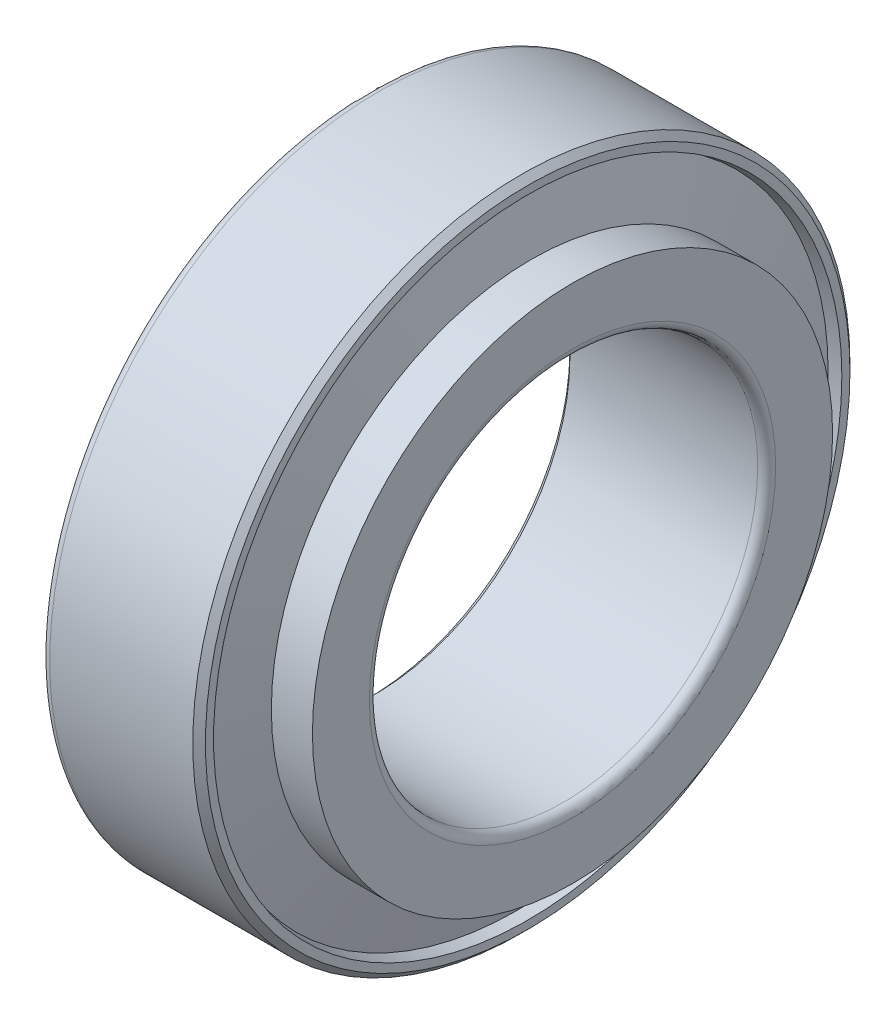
ISO-10303-21;
HEADER;
FILE_DESCRIPTION(('STEP AP214'),'2;1');
FILE_NAME('part.step','',(''),(''),'','','');
FILE_SCHEMA(('AUTOMOTIVE_DESIGN { 1 0 10303 214 1 1 1 1 }'));
ENDSEC;
DATA;
#1=APPLICATION_CONTEXT('core data for automotive mechanical design processes');
#2=APPLICATION_PROTOCOL_DEFINITION('international standard','automotive_design',2000,#1);
#3=PRODUCT_CONTEXT('',#1,'mechanical');
#4=PRODUCT('Part','Part','',(#3));
#5=PRODUCT_RELATED_PRODUCT_CATEGORY('part','',(#4));
#6=PRODUCT_DEFINITION_FORMATION('','',#4);
#7=PRODUCT_DEFINITION_CONTEXT('part definition',#1,'design');
#8=PRODUCT_DEFINITION('design','',#6,#7);
#9=PRODUCT_DEFINITION_SHAPE('','',#8);
#10=(LENGTH_UNIT() NAMED_UNIT(*) SI_UNIT(.MILLI.,.METRE.));
#11=(NAMED_UNIT(*) PLANE_ANGLE_UNIT() SI_UNIT($,.RADIAN.));
#12=(NAMED_UNIT(*) SI_UNIT($,.STERADIAN.) SOLID_ANGLE_UNIT());
#13=UNCERTAINTY_MEASURE_WITH_UNIT(LENGTH_MEASURE(1.E-05),#10,'distance_accuracy_value','');
#14=(GEOMETRIC_REPRESENTATION_CONTEXT(3) GLOBAL_UNCERTAINTY_ASSIGNED_CONTEXT((#13)) GLOBAL_UNIT_ASSIGNED_CONTEXT((#10,
#11,#12)) REPRESENTATION_CONTEXT('',''));
#15=CARTESIAN_POINT('',(0.,0.,0.));
#16=DIRECTION('',(0.,0.,1.));
#17=DIRECTION('',(1.,0.,0.));
#18=AXIS2_PLACEMENT_3D('',#15,#16,#17);
#19=CARTESIAN_POINT('',(-34.,0.,0.));
#20=DIRECTION('',(1.,0.,0.));
#21=DIRECTION('',(0.,0.,-1.));
#22=AXIS2_PLACEMENT_3D('',#19,#20,#21);
#23=CONICAL_SURFACE('',#22,45.827,0.249582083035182);
#24=CARTESIAN_POINT('',(-32.4446999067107,0.,0.));
#25=DIRECTION('',(-1.,0.,0.));
#26=DIRECTION('',(0.,0.,1.));
#27=AXIS2_PLACEMENT_3D('',#24,#25,#26);
#28=CIRCLE('',#27,46.2234410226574);
#29=CARTESIAN_POINT('',(-32.4446999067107,0.,46.2234410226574));
#30=VERTEX_POINT('',#29);
#31=EDGE_CURVE('E39',#30,#30,#28,.T.);
#32=ORIENTED_EDGE('',*,*,#31,.F.);
#33=EDGE_LOOP('',(#32));
#34=FACE_BOUND('',#33,.T.);
#35=CARTESIAN_POINT('',(-34.,0.,0.));
#36=DIRECTION('',(1.,0.,0.));
#37=DIRECTION('',(0.,0.,-1.));
#38=AXIS2_PLACEMENT_3D('',#35,#36,#37);
#39=CIRCLE('',#38,45.827);
#40=CARTESIAN_POINT('',(-34.,0.,-45.827));
#41=VERTEX_POINT('',#40);
#42=EDGE_CURVE('E51',#41,#41,#39,.T.);
#43=ORIENTED_EDGE('',*,*,#42,.F.);
#44=EDGE_LOOP('',(#43));
#45=FACE_BOUND('',#44,.T.);
#46=ADVANCED_FACE('F28',(#34,#45),#23,.F.);
#47=CARTESIAN_POINT('',(-7.5,53.94,0.));
#48=DIRECTION('',(1.,0.,0.));
#49=DIRECTION('',(0.,0.,-1.));
#50=AXIS2_PLACEMENT_3D('',#47,#48,#49);
#51=PLANE('',#50);
#52=CARTESIAN_POINT('',(-7.5,0.,0.));
#53=DIRECTION('',(1.,0.,0.));
#54=DIRECTION('',(0.,0.,-1.));
#55=AXIS2_PLACEMENT_3D('',#52,#53,#54);
#56=CIRCLE('',#55,53.94);
#57=CARTESIAN_POINT('',(-7.5,0.,-53.94));
#58=VERTEX_POINT('',#57);
#59=EDGE_CURVE('E63',#58,#58,#56,.T.);
#60=ORIENTED_EDGE('',*,*,#59,.T.);
#61=EDGE_LOOP('',(#60));
#62=FACE_BOUND('',#61,.T.);
#63=CARTESIAN_POINT('',(-7.5,0.,0.));
#64=DIRECTION('',(1.,0.,0.));
#65=DIRECTION('',(0.,0.,-1.));
#66=AXIS2_PLACEMENT_3D('',#63,#64,#65);
#67=CIRCLE('',#66,52.581765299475);
#68=CARTESIAN_POINT('',(-7.5,0.,-52.581765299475));
#69=VERTEX_POINT('',#68);
#70=EDGE_CURVE('E48',#69,#69,#67,.T.);
#71=ORIENTED_EDGE('',*,*,#70,.F.);
#72=EDGE_LOOP('',(#71));
#73=FACE_BOUND('',#72,.T.);
#74=ADVANCED_FACE('F30',(#62,#73),#51,.T.);
#75=CARTESIAN_POINT('',(-9.33367471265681,0.,0.));
#76=DIRECTION('',(-1.,0.,0.));
#77=DIRECTION('',(0.,0.,1.));
#78=AXIS2_PLACEMENT_3D('',#75,#76,#77);
#79=CIRCLE('',#78,52.1143674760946);
#80=CARTESIAN_POINT('',(-9.33367471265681,0.,52.1143674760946));
#81=VERTEX_POINT('',#80);
#82=EDGE_CURVE('E43',#81,#81,#79,.F.);
#83=ORIENTED_EDGE('',*,*,#82,.F.);
#84=EDGE_LOOP('',(#83));
#85=FACE_BOUND('',#84,.T.);
#86=ORIENTED_EDGE('',*,*,#70,.T.);
#87=EDGE_LOOP('',(#86));
#88=FACE_BOUND('',#87,.T.);
#89=ADVANCED_FACE('F116',(#85,#88),#23,.F.);
#90=CARTESIAN_POINT('',(-34.,45.827,0.));
#91=DIRECTION('',(-1.,0.,0.));
#92=DIRECTION('',(0.,0.,1.));
#93=AXIS2_PLACEMENT_3D('',#90,#91,#92);
#94=PLANE('',#93);
#95=ORIENTED_EDGE('',*,*,#42,.T.);
#96=EDGE_LOOP('',(#95));
#97=FACE_BOUND('',#96,.T.);
#98=CARTESIAN_POINT('',(-34.,0.,0.));
#99=DIRECTION('',(1.,0.,0.));
#100=DIRECTION('',(0.,0.,-1.));
#101=AXIS2_PLACEMENT_3D('',#98,#99,#100);
#102=CIRCLE('',#101,53.5);
#103=CARTESIAN_POINT('',(-34.,0.,-53.5));
#104=VERTEX_POINT('',#103);
#105=EDGE_CURVE('E54',#104,#104,#102,.T.);
#106=ORIENTED_EDGE('',*,*,#105,.F.);
#107=EDGE_LOOP('',(#106));
#108=FACE_BOUND('',#107,.T.);
#109=ADVANCED_FACE('F125',(#97,#108),#94,.T.);
#110=CARTESIAN_POINT('',(-32.5,0.,0.));
#111=DIRECTION('',(1.,0.,0.));
#112=DIRECTION('',(0.,0.,-1.));
#113=AXIS2_PLACEMENT_3D('',#110,#111,#112);
#114=TOROIDAL_SURFACE('',#113,53.5,1.5);
#115=ORIENTED_EDGE('',*,*,#105,.T.);
#116=EDGE_LOOP('',(#115));
#117=FACE_BOUND('',#116,.T.);
#118=CARTESIAN_POINT('',(-32.5,0.,0.));
#119=DIRECTION('',(1.,0.,0.));
#120=DIRECTION('',(0.,0.,-1.));
#121=AXIS2_PLACEMENT_3D('',#118,#119,#120);
#122=CIRCLE('',#121,55.);
#123=CARTESIAN_POINT('',(-32.5,0.,-55.));
#124=VERTEX_POINT('',#123);
#125=EDGE_CURVE('E57',#124,#124,#122,.T.);
#126=ORIENTED_EDGE('',*,*,#125,.F.);
#127=EDGE_LOOP('',(#126));
#128=FACE_BOUND('',#127,.T.);
#129=ADVANCED_FACE('F130',(#117,#128),#114,.T.);
#130=CARTESIAN_POINT('',(-42.5,0.,0.));
#131=DIRECTION('',(1.,0.,0.));
#132=DIRECTION('',(0.,0.,-1.));
#133=AXIS2_PLACEMENT_3D('',#130,#131,#132);
#134=CYLINDRICAL_SURFACE('',#133,55.);
#135=ORIENTED_EDGE('',*,*,#125,.T.);
#136=EDGE_LOOP('',(#135));
#137=FACE_BOUND('',#136,.T.);
#138=CARTESIAN_POINT('',(-8.56000000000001,0.,0.));
#139=DIRECTION('',(1.,0.,0.));
#140=DIRECTION('',(0.,0.,-1.));
#141=AXIS2_PLACEMENT_3D('',#138,#139,#140);
#142=CIRCLE('',#141,55.);
#143=CARTESIAN_POINT('',(-8.56000000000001,0.,-55.));
#144=VERTEX_POINT('',#143);
#145=EDGE_CURVE('E60',#144,#144,#142,.T.);
#146=ORIENTED_EDGE('',*,*,#145,.F.);
#147=EDGE_LOOP('',(#146));
#148=FACE_BOUND('',#147,.T.);
#149=ADVANCED_FACE('F152',(#137,#148),#134,.T.);
#150=CARTESIAN_POINT('',(-7.5,0.,0.));
#151=DIRECTION('',(-1.,0.,0.));
#152=DIRECTION('',(0.,0.,1.));
#153=AXIS2_PLACEMENT_3D('',#150,#151,#152);
#154=CONICAL_SURFACE('',#153,53.94,0.785398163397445);
#155=ORIENTED_EDGE('',*,*,#145,.T.);
#156=EDGE_LOOP('',(#155));
#157=FACE_BOUND('',#156,.T.);
#158=ORIENTED_EDGE('',*,*,#59,.F.);
#159=EDGE_LOOP('',(#158));
#160=FACE_BOUND('',#159,.T.);
#161=ADVANCED_FACE('F146',(#157,#160),#154,.T.);
#162=CARTESIAN_POINT('',(-32.5,0.,0.));
#163=DIRECTION('',(-1.,0.,0.));
#164=DIRECTION('',(0.,0.,1.));
#165=AXIS2_PLACEMENT_3D('',#162,#163,#164);
#166=CONICAL_SURFACE('',#165,46.4403919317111,1.32121424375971);
#167=CARTESIAN_POINT('',(-30.1281765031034,0.,0.));
#168=DIRECTION('',(-1.,0.,0.));
#169=DIRECTION('',(0.,0.,1.));
#170=AXIS2_PLACEMENT_3D('',#167,#168,#169);
#171=CIRCLE('',#170,37.1353576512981);
#172=CARTESIAN_POINT('',(-30.1281765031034,0.,37.1353576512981));
#173=VERTEX_POINT('',#172);
#174=EDGE_CURVE('E10',#173,#173,#171,.T.);
#175=ORIENTED_EDGE('',*,*,#174,.F.);
#176=EDGE_LOOP('',(#175));
#177=FACE_BOUND('',#176,.T.);
#178=ORIENTED_EDGE('',*,*,#31,.T.);
#179=EDGE_LOOP('',(#178));
#180=FACE_BOUND('',#179,.T.);
#181=ADVANCED_FACE('F140',(#177,#180),#166,.F.);
#182=CARTESIAN_POINT('',(-29.9991349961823,0.,0.));
#183=DIRECTION('',(1.,0.,0.));
#184=DIRECTION('',(0.,0.,-1.));
#185=AXIS2_PLACEMENT_3D('',#182,#183,#184);
#186=CONICAL_SURFACE('',#185,36.6291076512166,0.249582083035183);
#187=CARTESIAN_POINT('',(-29.9873935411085,0.,0.));
#188=DIRECTION('',(-1.,0.,0.));
#189=DIRECTION('',(0.,0.,1.));
#190=AXIS2_PLACEMENT_3D('',#187,#188,#189);
#191=CIRCLE('',#190,36.6321005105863);
#192=CARTESIAN_POINT('',(-29.9873935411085,0.,36.6321005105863));
#193=VERTEX_POINT('',#192);
#194=EDGE_CURVE('E35',#193,#193,#191,.F.);
#195=ORIENTED_EDGE('',*,*,#194,.F.);
#196=EDGE_LOOP('',(#195));
#197=FACE_BOUND('',#196,.T.);
#198=CARTESIAN_POINT('',(-6.88810980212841,0.,0.));
#199=DIRECTION('',(1.,0.,0.));
#200=DIRECTION('',(0.,0.,-1.));
#201=AXIS2_PLACEMENT_3D('',#198,#199,#200);
#202=CIRCLE('',#201,42.5200341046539);
#203=CARTESIAN_POINT('',(-6.88810980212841,0.,-42.5200341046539));
#204=VERTEX_POINT('',#203);
#205=EDGE_CURVE('E66',#204,#204,#202,.T.);
#206=ORIENTED_EDGE('',*,*,#205,.T.);
#207=EDGE_LOOP('',(#206));
#208=FACE_BOUND('',#207,.T.);
#209=ADVANCED_FACE('F111',(#197,#208),#186,.F.);
#210=CARTESIAN_POINT('',(-6.88810980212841,0.,0.));
#211=DIRECTION('',(-1.,0.,0.));
#212=DIRECTION('',(0.,0.,1.));
#213=AXIS2_PLACEMENT_3D('',#210,#211,#212);
#214=CONICAL_SURFACE('',#213,42.5200341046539,1.32121424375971);
#215=ORIENTED_EDGE('',*,*,#82,.T.);
#216=EDGE_LOOP('',(#215));
#217=FACE_BOUND('',#216,.T.);
#218=ORIENTED_EDGE('',*,*,#205,.F.);
#219=EDGE_LOOP('',(#218));
#220=FACE_BOUND('',#219,.T.);
#221=ADVANCED_FACE('F103',(#217,#220),#214,.T.);
#222=CARTESIAN_POINT('',(-29.9866306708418,0.,0.));
#223=DIRECTION('',(-1.,0.,0.));
#224=DIRECTION('',(0.,0.,1.));
#225=AXIS2_PLACEMENT_3D('',#222,#223,#224);
#226=CONICAL_SURFACE('',#225,36.6291076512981,1.32121424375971);
#227=ORIENTED_EDGE('',*,*,#194,.T.);
#228=EDGE_LOOP('',(#227));
#229=FACE_BOUND('',#228,.T.);
#230=CARTESIAN_POINT('',(-29.9866306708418,0.,0.));
#231=DIRECTION('',(1.,0.,0.));
#232=DIRECTION('',(0.,0.,-1.));
#233=AXIS2_PLACEMENT_3D('',#230,#231,#232);
#234=CIRCLE('',#233,36.6291076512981);
#235=CARTESIAN_POINT('',(-29.9866306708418,0.,-36.6291076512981));
#236=VERTEX_POINT('',#235);
#237=EDGE_CURVE('E93',#236,#236,#234,.T.);
#238=ORIENTED_EDGE('',*,*,#237,.F.);
#239=EDGE_LOOP('',(#238));
#240=FACE_BOUND('',#239,.T.);
#241=ADVANCED_FACE('F100',(#229,#240),#226,.T.);
#242=CARTESIAN_POINT('',(-42.5,0.,0.));
#243=DIRECTION('',(1.,0.,0.));
#244=DIRECTION('',(0.,0.,-1.));
#245=AXIS2_PLACEMENT_3D('',#242,#243,#244);
#246=CYLINDRICAL_SURFACE('',#245,37.1353576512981);
#247=ORIENTED_EDGE('',*,*,#174,.T.);
#248=EDGE_LOOP('',(#247));
#249=FACE_BOUND('',#248,.T.);
#250=CARTESIAN_POINT('',(-34.,0.,0.));
#251=DIRECTION('',(1.,0.,0.));
#252=DIRECTION('',(0.,0.,-1.));
#253=AXIS2_PLACEMENT_3D('',#250,#251,#252);
#254=CIRCLE('',#253,37.1353576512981);
#255=CARTESIAN_POINT('',(-34.,0.,-37.1353576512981));
#256=VERTEX_POINT('',#255);
#257=EDGE_CURVE('E69',#256,#256,#254,.T.);
#258=ORIENTED_EDGE('',*,*,#257,.T.);
#259=EDGE_LOOP('',(#258));
#260=FACE_BOUND('',#259,.T.);
#261=ADVANCED_FACE('F102',(#249,#260),#246,.T.);
#262=CARTESIAN_POINT('',(-34.,37.1353576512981,0.));
#263=DIRECTION('',(-1.,0.,0.));
#264=DIRECTION('',(0.,0.,1.));
#265=AXIS2_PLACEMENT_3D('',#262,#263,#264);
#266=PLANE('',#265);
#267=CARTESIAN_POINT('',(-34.,0.,0.));
#268=DIRECTION('',(1.,0.,0.));
#269=DIRECTION('',(0.,0.,-1.));
#270=AXIS2_PLACEMENT_3D('',#267,#268,#269);
#271=CIRCLE('',#270,33.56);
#272=CARTESIAN_POINT('',(-34.,0.,-33.56));
#273=VERTEX_POINT('',#272);
#274=EDGE_CURVE('E72',#273,#273,#271,.T.);
#275=ORIENTED_EDGE('',*,*,#274,.T.);
#276=EDGE_LOOP('',(#275));
#277=FACE_BOUND('',#276,.T.);
#278=ORIENTED_EDGE('',*,*,#257,.F.);
#279=EDGE_LOOP('',(#278));
#280=FACE_BOUND('',#279,.T.);
#281=ADVANCED_FACE('F109',(#277,#280),#266,.T.);
#282=CARTESIAN_POINT('',(-34.,0.,0.));
#283=DIRECTION('',(-1.,0.,0.));
#284=DIRECTION('',(0.,0.,1.));
#285=AXIS2_PLACEMENT_3D('',#282,#283,#284);
#286=CONICAL_SURFACE('',#285,33.56,0.785398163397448);
#287=CARTESIAN_POINT('',(-32.94,0.,0.));
#288=DIRECTION('',(1.,0.,0.));
#289=DIRECTION('',(0.,0.,-1.));
#290=AXIS2_PLACEMENT_3D('',#287,#288,#289);
#291=CIRCLE('',#290,32.5);
#292=CARTESIAN_POINT('',(-32.94,0.,-32.5));
#293=VERTEX_POINT('',#292);
#294=EDGE_CURVE('E75',#293,#293,#291,.T.);
#295=ORIENTED_EDGE('',*,*,#294,.T.);
#296=EDGE_LOOP('',(#295));
#297=FACE_BOUND('',#296,.T.);
#298=ORIENTED_EDGE('',*,*,#274,.F.);
#299=EDGE_LOOP('',(#298));
#300=FACE_BOUND('',#299,.T.);
#301=ADVANCED_FACE('F210',(#297,#300),#286,.F.);
#302=CARTESIAN_POINT('',(-42.5,0.,0.));
#303=DIRECTION('',(1.,0.,0.));
#304=DIRECTION('',(0.,0.,-1.));
#305=AXIS2_PLACEMENT_3D('',#302,#303,#304);
#306=CYLINDRICAL_SURFACE('',#305,32.5);
#307=CARTESIAN_POINT('',(-1.5,0.,0.));
#308=DIRECTION('',(1.,0.,0.));
#309=DIRECTION('',(0.,0.,-1.));
#310=AXIS2_PLACEMENT_3D('',#307,#308,#309);
#311=CIRCLE('',#310,32.5);
#312=CARTESIAN_POINT('',(-1.5,0.,-32.5));
#313=VERTEX_POINT('',#312);
#314=EDGE_CURVE('E78',#313,#313,#311,.T.);
#315=ORIENTED_EDGE('',*,*,#314,.T.);
#316=EDGE_LOOP('',(#315));
#317=FACE_BOUND('',#316,.T.);
#318=ORIENTED_EDGE('',*,*,#294,.F.);
#319=EDGE_LOOP('',(#318));
#320=FACE_BOUND('',#319,.T.);
#321=ADVANCED_FACE('F220',(#317,#320),#306,.F.);
#322=CARTESIAN_POINT('',(-1.5,0.,0.));
#323=DIRECTION('',(1.,0.,0.));
#324=DIRECTION('',(0.,0.,-1.));
#325=AXIS2_PLACEMENT_3D('',#322,#323,#324);
#326=TOROIDAL_SURFACE('',#325,34.,1.5);
#327=CARTESIAN_POINT('',(0.,0.,0.));
#328=DIRECTION('',(1.,0.,0.));
#329=DIRECTION('',(0.,0.,-1.));
#330=AXIS2_PLACEMENT_3D('',#327,#328,#329);
#331=CIRCLE('',#330,34.);
#332=CARTESIAN_POINT('',(0.,0.,-34.));
#333=VERTEX_POINT('',#332);
#334=EDGE_CURVE('E81',#333,#333,#331,.T.);
#335=ORIENTED_EDGE('',*,*,#334,.T.);
#336=EDGE_LOOP('',(#335));
#337=FACE_BOUND('',#336,.T.);
#338=ORIENTED_EDGE('',*,*,#314,.F.);
#339=EDGE_LOOP('',(#338));
#340=FACE_BOUND('',#339,.T.);
#341=ADVANCED_FACE('F230',(#337,#340),#326,.T.);
#342=CARTESIAN_POINT('',(0.,34.,0.));
#343=DIRECTION('',(1.,0.,0.));
#344=DIRECTION('',(0.,0.,-1.));
#345=AXIS2_PLACEMENT_3D('',#342,#343,#344);
#346=PLANE('',#345);
#347=CARTESIAN_POINT('',(0.,0.,0.));
#348=DIRECTION('',(1.,0.,0.));
#349=DIRECTION('',(0.,0.,-1.));
#350=AXIS2_PLACEMENT_3D('',#347,#348,#349);
#351=CIRCLE('',#350,43.5325341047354);
#352=CARTESIAN_POINT('',(0.,0.,-43.5325341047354));
#353=VERTEX_POINT('',#352);
#354=EDGE_CURVE('E84',#353,#353,#351,.T.);
#355=ORIENTED_EDGE('',*,*,#354,.T.);
#356=EDGE_LOOP('',(#355));
#357=FACE_BOUND('',#356,.T.);
#358=ORIENTED_EDGE('',*,*,#334,.F.);
#359=EDGE_LOOP('',(#358));
#360=FACE_BOUND('',#359,.T.);
#361=ADVANCED_FACE('F240',(#357,#360),#346,.T.);
#362=CARTESIAN_POINT('',(-42.5,0.,0.));
#363=DIRECTION('',(1.,0.,0.));
#364=DIRECTION('',(0.,0.,-1.));
#365=AXIS2_PLACEMENT_3D('',#362,#363,#364);
#366=CYLINDRICAL_SURFACE('',#365,43.5325341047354);
#367=CARTESIAN_POINT('',(-6.87560547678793,0.,0.));
#368=DIRECTION('',(1.,0.,0.));
#369=DIRECTION('',(0.,0.,-1.));
#370=AXIS2_PLACEMENT_3D('',#367,#368,#369);
#371=CIRCLE('',#370,43.5325341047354);
#372=CARTESIAN_POINT('',(-6.87560547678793,0.,-43.5325341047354));
#373=VERTEX_POINT('',#372);
#374=EDGE_CURVE('E87',#373,#373,#371,.T.);
#375=ORIENTED_EDGE('',*,*,#374,.T.);
#376=EDGE_LOOP('',(#375));
#377=FACE_BOUND('',#376,.T.);
#378=ORIENTED_EDGE('',*,*,#354,.F.);
#379=EDGE_LOOP('',(#378));
#380=FACE_BOUND('',#379,.T.);
#381=ADVANCED_FACE('F250',(#377,#380),#366,.T.);
#382=CARTESIAN_POINT('',(-6.87560547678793,43.5325341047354,0.));
#383=DIRECTION('',(-1.,0.,0.));
#384=DIRECTION('',(0.,0.,1.));
#385=AXIS2_PLACEMENT_3D('',#382,#383,#384);
#386=PLANE('',#385);
#387=CARTESIAN_POINT('',(-6.87560547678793,0.,0.));
#388=DIRECTION('',(1.,0.,0.));
#389=DIRECTION('',(0.,0.,-1.));
#390=AXIS2_PLACEMENT_3D('',#387,#388,#389);
#391=CIRCLE('',#390,42.5200341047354);
#392=CARTESIAN_POINT('',(-6.87560547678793,0.,-42.5200341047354));
#393=VERTEX_POINT('',#392);
#394=EDGE_CURVE('E90',#393,#393,#391,.T.);
#395=ORIENTED_EDGE('',*,*,#394,.T.);
#396=EDGE_LOOP('',(#395));
#397=FACE_BOUND('',#396,.T.);
#398=ORIENTED_EDGE('',*,*,#374,.F.);
#399=EDGE_LOOP('',(#398));
#400=FACE_BOUND('',#399,.T.);
#401=ADVANCED_FACE('F260',(#397,#400),#386,.T.);
#402=CARTESIAN_POINT('',(-6.87560547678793,0.,0.));
#403=DIRECTION('',(1.,0.,0.));
#404=DIRECTION('',(0.,0.,-1.));
#405=AXIS2_PLACEMENT_3D('',#402,#403,#404);
#406=CONICAL_SURFACE('',#405,42.5200341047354,0.249582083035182);
#407=ORIENTED_EDGE('',*,*,#237,.T.);
#408=EDGE_LOOP('',(#407));
#409=FACE_BOUND('',#408,.T.);
#410=ORIENTED_EDGE('',*,*,#394,.F.);
#411=EDGE_LOOP('',(#410));
#412=FACE_BOUND('',#411,.T.);
#413=ADVANCED_FACE('F97',(#409,#412),#406,.T.);
#414=CLOSED_SHELL('',(#46,#74,#89,#109,#129,#149,#161,#181,#209,#221,#241,#261,#281,#301,#321,
#341,#361,#381,#401,#413));
#415=MANIFOLD_SOLID_BREP('B2',#414);
#416=ADVANCED_BREP_SHAPE_REPRESENTATION('',(#18,#415),#14);
#417=SHAPE_DEFINITION_REPRESENTATION(#9,#416);
ENDSEC;
END-ISO-10303-21;
